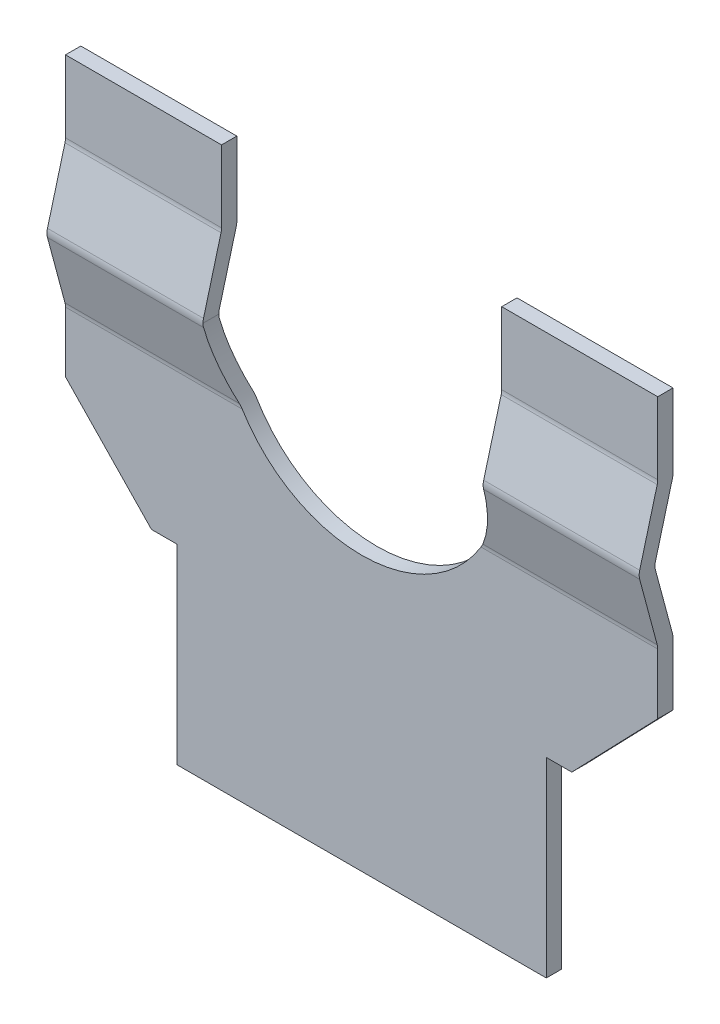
ISO-10303-21;
HEADER;
FILE_DESCRIPTION(('STEP AP214'),'2;1');
FILE_NAME('part.step','',(''),(''),'','','');
FILE_SCHEMA(('AUTOMOTIVE_DESIGN { 1 0 10303 214 1 1 1 1 }'));
ENDSEC;
DATA;
#1=APPLICATION_CONTEXT('core data for automotive mechanical design processes');
#2=APPLICATION_PROTOCOL_DEFINITION('international standard','automotive_design',2000,#1);
#3=PRODUCT_CONTEXT('',#1,'mechanical');
#4=PRODUCT('Part','Part','',(#3));
#5=PRODUCT_RELATED_PRODUCT_CATEGORY('part','',(#4));
#6=PRODUCT_DEFINITION_FORMATION('','',#4);
#7=PRODUCT_DEFINITION_CONTEXT('part definition',#1,'design');
#8=PRODUCT_DEFINITION('design','',#6,#7);
#9=PRODUCT_DEFINITION_SHAPE('','',#8);
#10=(LENGTH_UNIT() NAMED_UNIT(*) SI_UNIT(.MILLI.,.METRE.));
#11=(NAMED_UNIT(*) PLANE_ANGLE_UNIT() SI_UNIT($,.RADIAN.));
#12=(NAMED_UNIT(*) SI_UNIT($,.STERADIAN.) SOLID_ANGLE_UNIT());
#13=UNCERTAINTY_MEASURE_WITH_UNIT(LENGTH_MEASURE(1.E-05),#10,'distance_accuracy_value','');
#14=(GEOMETRIC_REPRESENTATION_CONTEXT(3) GLOBAL_UNCERTAINTY_ASSIGNED_CONTEXT((#13)) GLOBAL_UNIT_ASSIGNED_CONTEXT((#10,
#11,#12)) REPRESENTATION_CONTEXT('',''));
#15=CARTESIAN_POINT('',(0.,0.,0.));
#16=DIRECTION('',(0.,0.,1.));
#17=DIRECTION('',(1.,0.,0.));
#18=AXIS2_PLACEMENT_3D('',#15,#16,#17);
#19=CARTESIAN_POINT('',(0.,325.,0.));
#20=DIRECTION('',(0.,0.,1.));
#21=DIRECTION('',(-1.,0.,0.));
#22=AXIS2_PLACEMENT_3D('',#19,#20,#21);
#23=PLANE('',#22);
#24=DIRECTION('',(0.,-1.,0.));
#25=VECTOR('',#24,1.);
#26=CARTESIAN_POINT('',(232.5,220.,0.));
#27=LINE('',#26,#25);
#28=CARTESIAN_POINT('',(232.5,269.019237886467,0.));
#29=VERTEX_POINT('',#28);
#30=CARTESIAN_POINT('',(232.5,220.,0.));
#31=VERTEX_POINT('',#30);
#32=EDGE_CURVE('E482',#29,#31,#27,.T.);
#33=ORIENTED_EDGE('',*,*,#32,.T.);
#34=DIRECTION('',(-0.694135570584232,-0.719844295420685,0.));
#35=VECTOR('',#34,1.);
#36=CARTESIAN_POINT('',(165.,150.,0.));
#37=LINE('',#36,#35);
#38=CARTESIAN_POINT('',(165.,150.,0.));
#39=VERTEX_POINT('',#38);
#40=EDGE_CURVE('E486',#31,#39,#37,.T.);
#41=ORIENTED_EDGE('',*,*,#40,.T.);
#42=DIRECTION('',(-1.,0.,0.));
#43=VECTOR('',#42,1.);
#44=CARTESIAN_POINT('',(145.,150.,0.));
#45=LINE('',#44,#43);
#46=CARTESIAN_POINT('',(145.,150.,0.));
#47=VERTEX_POINT('',#46);
#48=EDGE_CURVE('E489',#39,#47,#45,.T.);
#49=ORIENTED_EDGE('',*,*,#48,.T.);
#50=DIRECTION('',(0.,-1.,0.));
#51=VECTOR('',#50,1.);
#52=CARTESIAN_POINT('',(145.,0.,0.));
#53=LINE('',#52,#51);
#54=CARTESIAN_POINT('',(145.,0.,0.));
#55=VERTEX_POINT('',#54);
#56=EDGE_CURVE('E492',#47,#55,#53,.T.);
#57=ORIENTED_EDGE('',*,*,#56,.T.);
#58=DIRECTION('',(-1.,0.,0.));
#59=VECTOR('',#58,1.);
#60=CARTESIAN_POINT('',(145.,0.,0.));
#61=LINE('',#60,#59);
#62=CARTESIAN_POINT('',(-145.,0.,0.));
#63=VERTEX_POINT('',#62);
#64=EDGE_CURVE('E495',#55,#63,#61,.T.);
#65=ORIENTED_EDGE('',*,*,#64,.T.);
#66=DIRECTION('',(0.,1.,0.));
#67=VECTOR('',#66,1.);
#68=CARTESIAN_POINT('',(-145.,0.,0.));
#69=LINE('',#68,#67);
#70=CARTESIAN_POINT('',(-145.,150.,0.));
#71=VERTEX_POINT('',#70);
#72=EDGE_CURVE('E498',#63,#71,#69,.T.);
#73=ORIENTED_EDGE('',*,*,#72,.T.);
#74=DIRECTION('',(-1.,0.,0.));
#75=VECTOR('',#74,1.);
#76=CARTESIAN_POINT('',(-145.,150.,0.));
#77=LINE('',#76,#75);
#78=CARTESIAN_POINT('',(-165.,150.,0.));
#79=VERTEX_POINT('',#78);
#80=EDGE_CURVE('E501',#71,#79,#77,.T.);
#81=ORIENTED_EDGE('',*,*,#80,.T.);
#82=DIRECTION('',(-0.694135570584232,0.719844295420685,0.));
#83=VECTOR('',#82,1.);
#84=CARTESIAN_POINT('',(-165.,150.,0.));
#85=LINE('',#84,#83);
#86=CARTESIAN_POINT('',(-232.5,220.,0.));
#87=VERTEX_POINT('',#86);
#88=EDGE_CURVE('E504',#79,#87,#85,.T.);
#89=ORIENTED_EDGE('',*,*,#88,.T.);
#90=DIRECTION('',(0.,1.,0.));
#91=VECTOR('',#90,1.);
#92=CARTESIAN_POINT('',(-232.5,220.,0.));
#93=LINE('',#92,#91);
#94=CARTESIAN_POINT('',(-232.5,269.019237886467,0.));
#95=VERTEX_POINT('',#94);
#96=EDGE_CURVE('E311',#87,#95,#93,.T.);
#97=ORIENTED_EDGE('',*,*,#96,.T.);
#98=DIRECTION('',(-1.,0.,0.));
#99=VECTOR('',#98,1.);
#100=CARTESIAN_POINT('',(0.,269.019237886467,0.));
#101=LINE('',#100,#99);
#102=CARTESIAN_POINT('',(-94.6897791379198,269.019237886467,0.));
#103=VERTEX_POINT('',#102);
#104=EDGE_CURVE('E646',#103,#95,#101,.T.);
#105=ORIENTED_EDGE('',*,*,#104,.F.);
#106=CARTESIAN_POINT('',(0.,325.,0.));
#107=DIRECTION('',(0.,0.,1.));
#108=DIRECTION('',(-1.,0.,0.));
#109=AXIS2_PLACEMENT_3D('',#106,#107,#108);
#110=CIRCLE('',#109,110.);
#111=CARTESIAN_POINT('',(94.6897791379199,269.019237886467,0.));
#112=VERTEX_POINT('',#111);
#113=EDGE_CURVE('E473',#103,#112,#110,.T.);
#114=ORIENTED_EDGE('',*,*,#113,.T.);
#115=DIRECTION('',(-1.,0.,0.));
#116=VECTOR('',#115,1.);
#117=CARTESIAN_POINT('',(0.,269.019237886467,0.));
#118=LINE('',#117,#116);
#119=EDGE_CURVE('E649',#29,#112,#118,.T.);
#120=ORIENTED_EDGE('',*,*,#119,.F.);
#121=EDGE_LOOP('',(#33,#41,#49,#57,#65,#73,#81,#89,#97,#105,#114,#120));
#122=FACE_BOUND('',#121,.T.);
#123=ADVANCED_FACE('F34',(#122),#23,.F.);
#124=CARTESIAN_POINT('',(-232.5,380.980762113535,0.));
#125=VERTEX_POINT('',#124);
#126=CARTESIAN_POINT('',(-232.5,439.,0.));
#127=VERTEX_POINT('',#126);
#128=EDGE_CURVE('E506',#125,#127,#93,.T.);
#129=ORIENTED_EDGE('',*,*,#128,.T.);
#130=DIRECTION('',(1.,0.,0.));
#131=VECTOR('',#130,1.);
#132=CARTESIAN_POINT('',(-232.5,439.,0.));
#133=LINE('',#132,#131);
#134=CARTESIAN_POINT('',(-110.,439.,0.));
#135=VERTEX_POINT('',#134);
#136=EDGE_CURVE('E508',#127,#135,#133,.T.);
#137=ORIENTED_EDGE('',*,*,#136,.T.);
#138=DIRECTION('',(0.,-1.,0.));
#139=VECTOR('',#138,1.);
#140=CARTESIAN_POINT('',(-110.,439.,0.));
#141=LINE('',#140,#139);
#142=CARTESIAN_POINT('',(-110.,380.980762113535,0.));
#143=VERTEX_POINT('',#142);
#144=EDGE_CURVE('E470',#135,#143,#141,.T.);
#145=ORIENTED_EDGE('',*,*,#144,.T.);
#146=DIRECTION('',(1.,0.,0.));
#147=VECTOR('',#146,1.);
#148=CARTESIAN_POINT('',(0.,380.980762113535,0.));
#149=LINE('',#148,#147);
#150=EDGE_CURVE('E524',#125,#143,#149,.T.);
#151=ORIENTED_EDGE('',*,*,#150,.F.);
#152=EDGE_LOOP('',(#129,#137,#145,#151));
#153=FACE_BOUND('',#152,.T.);
#154=ADVANCED_FACE('F522',(#153),#23,.F.);
#155=CARTESIAN_POINT('',(-110.,439.,27.));
#156=DIRECTION('',(-1.,0.,0.));
#157=DIRECTION('',(0.,1.,0.));
#158=AXIS2_PLACEMENT_3D('',#155,#156,#157);
#159=PLANE('',#158);
#160=DIRECTION('',(0.,0.,-1.));
#161=VECTOR('',#160,1.);
#162=CARTESIAN_POINT('',(-110.,325.,27.));
#163=LINE('',#162,#161);
#164=CARTESIAN_POINT('',(-110.,325.,26.576685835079));
#165=VERTEX_POINT('',#164);
#166=CARTESIAN_POINT('',(-110.,325.,14.153371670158));
#167=VERTEX_POINT('',#166);
#168=EDGE_CURVE('E341',#165,#167,#163,.T.);
#169=ORIENTED_EDGE('',*,*,#168,.T.);
#170=CARTESIAN_POINT('',(-110.,325.,2.15337167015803));
#171=DIRECTION('',(1.,0.,0.));
#172=DIRECTION('',(0.,1.,0.));
#173=AXIS2_PLACEMENT_3D('',#170,#171,#172);
#174=CIRCLE('',#173,12.);
#175=CARTESIAN_POINT('',(-110.,328.10582854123,13.7444815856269));
#176=VERTEX_POINT('',#175);
#177=EDGE_CURVE('E46',#176,#167,#174,.T.);
#178=ORIENTED_EDGE('',*,*,#177,.F.);
#179=DIRECTION('',(0.,-0.96592582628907,0.258819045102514));
#180=VECTOR('',#179,1.);
#181=CARTESIAN_POINT('',(-110.,428.257619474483,-13.0911099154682));
#182=LINE('',#181,#180);
#183=CARTESIAN_POINT('',(-110.,377.874933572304,0.408890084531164));
#184=VERTEX_POINT('',#183);
#185=EDGE_CURVE('E695',#184,#176,#182,.T.);
#186=ORIENTED_EDGE('',*,*,#185,.F.);
#187=CARTESIAN_POINT('',(-110.,380.980762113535,12.));
#188=DIRECTION('',(1.,0.,0.));
#189=DIRECTION('',(0.,1.,0.));
#190=AXIS2_PLACEMENT_3D('',#187,#188,#189);
#191=CIRCLE('',#190,12.);
#192=EDGE_CURVE('E430',#143,#184,#191,.F.);
#193=ORIENTED_EDGE('',*,*,#192,.F.);
#194=ORIENTED_EDGE('',*,*,#144,.F.);
#195=DIRECTION('',(0.,0.,-1.));
#196=VECTOR('',#195,1.);
#197=CARTESIAN_POINT('',(-110.,439.,27.));
#198=LINE('',#197,#196);
#199=CARTESIAN_POINT('',(-110.,439.,12.));
#200=VERTEX_POINT('',#199);
#201=EDGE_CURVE('E317',#200,#135,#198,.T.);
#202=ORIENTED_EDGE('',*,*,#201,.F.);
#203=DIRECTION('',(0.,1.,0.));
#204=VECTOR('',#203,1.);
#205=CARTESIAN_POINT('',(-110.,439.,12.));
#206=LINE('',#205,#204);
#207=CARTESIAN_POINT('',(-110.,382.560592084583,12.));
#208=VERTEX_POINT('',#207);
#209=EDGE_CURVE('E450',#208,#200,#206,.T.);
#210=ORIENTED_EDGE('',*,*,#209,.F.);
#211=CARTESIAN_POINT('',(-110.,382.560592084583,24.));
#212=DIRECTION('',(1.,0.,0.));
#213=DIRECTION('',(0.,1.,0.));
#214=AXIS2_PLACEMENT_3D('',#211,#212,#213);
#215=CIRCLE('',#214,12.);
#216=CARTESIAN_POINT('',(-110.,379.454763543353,12.4088900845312));
#217=VERTEX_POINT('',#216);
#218=EDGE_CURVE('E670',#217,#208,#215,.T.);
#219=ORIENTED_EDGE('',*,*,#218,.F.);
#220=DIRECTION('',(0.,0.96592582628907,-0.258819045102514));
#221=VECTOR('',#220,1.);
#222=CARTESIAN_POINT('',(-110.,431.363448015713,-1.49999999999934));
#223=LINE('',#222,#221);
#224=CARTESIAN_POINT('',(-110.,328.10582854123,26.1677957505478));
#225=VERTEX_POINT('',#224);
#226=EDGE_CURVE('E441',#225,#217,#223,.T.);
#227=ORIENTED_EDGE('',*,*,#226,.F.);
#228=CARTESIAN_POINT('',(-110.,325.,14.576685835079));
#229=DIRECTION('',(1.,0.,0.));
#230=DIRECTION('',(0.,1.,0.));
#231=AXIS2_PLACEMENT_3D('',#228,#229,#230);
#232=CIRCLE('',#231,12.);
#233=EDGE_CURVE('E422',#165,#225,#232,.F.);
#234=ORIENTED_EDGE('',*,*,#233,.F.);
#235=EDGE_LOOP('',(#169,#178,#186,#193,#194,#202,#210,#219,#227,#234));
#236=FACE_BOUND('',#235,.T.);
#237=ADVANCED_FACE('F36',(#236),#159,.F.);
#238=CARTESIAN_POINT('',(0.,325.,27.));
#239=DIRECTION('',(0.,0.,-1.));
#240=DIRECTION('',(1.,0.,0.));
#241=AXIS2_PLACEMENT_3D('',#238,#239,#240);
#242=CYLINDRICAL_SURFACE('',#241,110.);
#243=CARTESIAN_POINT('',(0.,325.,27.));
#244=DIRECTION('',(0.,-0.258819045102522,0.965925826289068));
#245=DIRECTION('',(0.,-0.965925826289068,-0.258819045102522));
#246=AXIS2_PLACEMENT_3D('',#243,#244,#245);
#247=ELLIPSE('',#246,113.880379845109,110.);
#248=CARTESIAN_POINT('',(-95.575513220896,270.545236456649,12.4088900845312));
#249=VERTEX_POINT('',#248);
#250=CARTESIAN_POINT('',(-109.956145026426,321.89417145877,26.1677957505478));
#251=VERTEX_POINT('',#250);
#252=EDGE_CURVE('E428',#249,#251,#247,.F.);
#253=ORIENTED_EDGE('',*,*,#252,.F.);
#254=CARTESIAN_POINT('',(-93.7378164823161,267.439407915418,12.));
#255=CARTESIAN_POINT('',(-93.8968021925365,267.698306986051,11.9999993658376));
#256=CARTESIAN_POINT('',(-94.054714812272,267.95788452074,12.0083790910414));
#257=CARTESIAN_POINT('',(-94.3673825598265,268.476657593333,12.0420965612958));
#258=CARTESIAN_POINT('',(-94.5221464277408,268.735851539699,12.0673779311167));
#259=CARTESIAN_POINT('',(-94.8285722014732,269.253857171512,12.1350939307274));
#260=CARTESIAN_POINT('',(-94.9802340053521,269.512668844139,12.1775291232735));
#261=CARTESIAN_POINT('',(-95.2804615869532,270.029793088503,12.2799475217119));
#262=CARTESIAN_POINT('',(-95.4290153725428,270.28810112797,12.3399886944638));
#263=CARTESIAN_POINT('',(-95.575513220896,270.545236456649,12.4088900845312));
#264=B_SPLINE_CURVE_WITH_KNOTS('',3,(#254,#255,#256,#257,#258,#259,#260,#261,#262,#263),
.UNSPECIFIED.,.F.,.F.,(4,2,2,2,4),(0.,0.911358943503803,1.81969312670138,2.72805711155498,
3.63944608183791),.UNSPECIFIED.);
#265=CARTESIAN_POINT('',(-93.7378164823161,267.439407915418,12.));
#266=VERTEX_POINT('',#265);
#267=EDGE_CURVE('E591',#266,#249,#264,.T.);
#268=ORIENTED_EDGE('',*,*,#267,.F.);
#269=CARTESIAN_POINT('',(0.,325.,12.));
#270=DIRECTION('',(0.,0.,1.));
#271=DIRECTION('',(0.,1.,0.));
#272=AXIS2_PLACEMENT_3D('',#269,#270,#271);
#273=CIRCLE('',#272,110.);
#274=CARTESIAN_POINT('',(93.7378164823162,267.439407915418,12.));
#275=VERTEX_POINT('',#274);
#276=EDGE_CURVE('E468',#275,#266,#273,.F.);
#277=ORIENTED_EDGE('',*,*,#276,.F.);
#278=CARTESIAN_POINT('',(95.5755132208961,270.545236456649,12.4088900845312));
#279=CARTESIAN_POINT('',(95.4290153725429,270.28810112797,12.3399886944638));
#280=CARTESIAN_POINT('',(95.2804615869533,270.029793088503,12.2799475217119));
#281=CARTESIAN_POINT('',(94.9802340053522,269.512668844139,12.1775291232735));
#282=CARTESIAN_POINT('',(94.8285722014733,269.253857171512,12.1350939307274));
#283=CARTESIAN_POINT('',(94.5221464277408,268.735851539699,12.0673779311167));
#284=CARTESIAN_POINT('',(94.3673825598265,268.476657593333,12.0420965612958));
#285=CARTESIAN_POINT('',(94.0547148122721,267.95788452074,12.0083790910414));
#286=CARTESIAN_POINT('',(93.8968021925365,267.698306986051,11.9999993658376));
#287=CARTESIAN_POINT('',(93.7378164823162,267.439407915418,12.));
#288=B_SPLINE_CURVE_WITH_KNOTS('',3,(#278,#279,#280,#281,#282,#283,#284,#285,#286,#287),
.UNSPECIFIED.,.F.,.F.,(4,2,2,2,4),(0.,0.911388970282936,1.81975295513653,2.72808713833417,
3.63944608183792),.UNSPECIFIED.);
#289=CARTESIAN_POINT('',(95.5755132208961,270.545236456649,12.4088900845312));
#290=VERTEX_POINT('',#289);
#291=EDGE_CURVE('E582',#290,#275,#288,.T.);
#292=ORIENTED_EDGE('',*,*,#291,.F.);
#293=CARTESIAN_POINT('',(109.956145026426,321.89417145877,26.1677957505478));
#294=VERTEX_POINT('',#293);
#295=EDGE_CURVE('E438',#294,#290,#247,.F.);
#296=ORIENTED_EDGE('',*,*,#295,.F.);
#297=CARTESIAN_POINT('',(110.,325.,26.576685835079));
#298=CARTESIAN_POINT('',(110.000005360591,324.737599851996,26.5766986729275));
#299=CARTESIAN_POINT('',(109.999061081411,324.475201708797,26.568079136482));
#300=CARTESIAN_POINT('',(109.99532164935,323.952675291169,26.5337461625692));
#301=CARTESIAN_POINT('',(109.99253449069,323.69254210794,26.5081065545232));
#302=CARTESIAN_POINT('',(109.985157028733,323.174530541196,26.4399024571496));
#303=CARTESIAN_POINT('',(109.980566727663,322.916652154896,26.3973379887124));
#304=CARTESIAN_POINT('',(109.969645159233,322.403145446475,26.2952712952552));
#305=CARTESIAN_POINT('',(109.963306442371,322.147531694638,26.2356965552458));
#306=CARTESIAN_POINT('',(109.956145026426,321.89417145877,26.1677957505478));
#307=B_SPLINE_CURVE_WITH_KNOTS('',3,(#297,#298,#299,#300,#301,#302,#303,#304,#305,#306),
.UNSPECIFIED.,.F.,.F.,(4,2,2,2,4),(0.,0.787054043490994,1.57071613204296,2.35437725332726,
3.14143032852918),.UNSPECIFIED.);
#308=CARTESIAN_POINT('',(110.,325.,26.576685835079));
#309=VERTEX_POINT('',#308);
#310=EDGE_CURVE('E431',#309,#294,#307,.T.);
#311=ORIENTED_EDGE('',*,*,#310,.F.);
#312=DIRECTION('',(0.,0.,-1.));
#313=VECTOR('',#312,1.);
#314=CARTESIAN_POINT('',(110.,325.,27.));
#315=LINE('',#314,#313);
#316=CARTESIAN_POINT('',(110.,325.,14.153371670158));
#317=VERTEX_POINT('',#316);
#318=EDGE_CURVE('E338',#309,#317,#315,.T.);
#319=ORIENTED_EDGE('',*,*,#318,.T.);
#320=CARTESIAN_POINT('',(109.956145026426,321.89417145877,13.7444815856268));
#321=CARTESIAN_POINT('',(109.963306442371,322.147531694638,13.8123823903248));
#322=CARTESIAN_POINT('',(109.969645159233,322.403145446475,13.8719571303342));
#323=CARTESIAN_POINT('',(109.980566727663,322.916652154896,13.9740238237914));
#324=CARTESIAN_POINT('',(109.985157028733,323.174530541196,14.0165882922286));
#325=CARTESIAN_POINT('',(109.99253449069,323.69254210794,14.0847923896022));
#326=CARTESIAN_POINT('',(109.99532164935,323.952675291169,14.1104319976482));
#327=CARTESIAN_POINT('',(109.999061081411,324.475201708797,14.1447649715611));
#328=CARTESIAN_POINT('',(110.000005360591,324.737599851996,14.1533845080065));
#329=CARTESIAN_POINT('',(110.,325.,14.153371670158));
#330=B_SPLINE_CURVE_WITH_KNOTS('',3,(#320,#321,#322,#323,#324,#325,#326,#327,#328,#329),
.UNSPECIFIED.,.F.,.F.,(4,2,2,2,4),(0.,0.787053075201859,1.57071419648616,2.35437628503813,
3.14143032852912),.UNSPECIFIED.);
#331=CARTESIAN_POINT('',(109.956145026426,321.89417145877,13.7444815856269));
#332=VERTEX_POINT('',#331);
#333=EDGE_CURVE('E398',#332,#317,#330,.T.);
#334=ORIENTED_EDGE('',*,*,#333,.F.);
#335=CARTESIAN_POINT('',(0.,325.,14.576685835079));
#336=DIRECTION('',(0.,0.258819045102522,-0.965925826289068));
#337=DIRECTION('',(0.,-0.965925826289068,-0.258819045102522));
#338=AXIS2_PLACEMENT_3D('',#335,#336,#337);
#339=ELLIPSE('',#338,113.880379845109,110.);
#340=CARTESIAN_POINT('',(96.4584957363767,272.125066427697,0.4088900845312));
#341=VERTEX_POINT('',#340);
#342=EDGE_CURVE('E296',#341,#332,#339,.F.);
#343=ORIENTED_EDGE('',*,*,#342,.F.);
#344=CARTESIAN_POINT('',(94.6897791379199,269.019237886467,0.));
#345=CARTESIAN_POINT('',(94.8429469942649,269.278306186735,-1.33023910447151E-06));
#346=CARTESIAN_POINT('',(94.9950504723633,269.538022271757,0.00839002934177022));
#347=CARTESIAN_POINT('',(95.2961385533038,270.056980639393,0.0421376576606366));
#348=CARTESIAN_POINT('',(95.445131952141,270.316221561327,0.067436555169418));
#349=CARTESIAN_POINT('',(95.7400551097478,270.834229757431,0.135176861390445));
#350=CARTESIAN_POINT('',(95.8859847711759,271.092997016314,0.177618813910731));
#351=CARTESIAN_POINT('',(96.1747903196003,271.609944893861,0.280020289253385));
#352=CARTESIAN_POINT('',(96.3176541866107,271.868120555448,0.34003866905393));
#353=CARTESIAN_POINT('',(96.4584957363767,272.125066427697,0.408890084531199));
#354=B_SPLINE_CURVE_WITH_KNOTS('',3,(#344,#345,#346,#347,#348,#349,#350,#351,#352,#353),
.UNSPECIFIED.,.F.,.F.,(4,2,2,2,4),(0.,0.902782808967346,1.80251771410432,2.70228116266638,
3.60509272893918),.UNSPECIFIED.);
#355=EDGE_CURVE('E370',#112,#341,#354,.T.);
#356=ORIENTED_EDGE('',*,*,#355,.F.);
#357=ORIENTED_EDGE('',*,*,#113,.F.);
#358=CARTESIAN_POINT('',(-96.4584957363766,272.125066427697,0.40889008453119));
#359=CARTESIAN_POINT('',(-96.3176541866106,271.868120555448,0.340038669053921));
#360=CARTESIAN_POINT('',(-96.1747903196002,271.609944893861,0.280020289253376));
#361=CARTESIAN_POINT('',(-95.8859847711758,271.092997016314,0.177618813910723));
#362=CARTESIAN_POINT('',(-95.7400551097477,270.834229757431,0.135176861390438));
#363=CARTESIAN_POINT('',(-95.4451319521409,270.316221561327,0.0674365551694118));
#364=CARTESIAN_POINT('',(-95.2961385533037,270.056980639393,0.0421376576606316));
#365=CARTESIAN_POINT('',(-94.9950504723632,269.538022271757,0.00839002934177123));
#366=CARTESIAN_POINT('',(-94.8429469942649,269.278306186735,-1.33023910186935E-06));
#367=CARTESIAN_POINT('',(-94.6897791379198,269.019237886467,0.));
#368=B_SPLINE_CURVE_WITH_KNOTS('',3,(#358,#359,#360,#361,#362,#363,#364,#365,#366,#367),
.UNSPECIFIED.,.F.,.F.,(4,2,2,2,4),(0.,0.902811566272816,1.80257501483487,2.7023099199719,
3.60509272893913),.UNSPECIFIED.);
#369=CARTESIAN_POINT('',(-96.4584957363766,272.125066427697,0.408890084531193));
#370=VERTEX_POINT('',#369);
#371=EDGE_CURVE('E364',#370,#103,#368,.T.);
#372=ORIENTED_EDGE('',*,*,#371,.F.);
#373=CARTESIAN_POINT('',(-109.956145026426,321.89417145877,13.7444815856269));
#374=VERTEX_POINT('',#373);
#375=EDGE_CURVE('E692',#374,#370,#339,.F.);
#376=ORIENTED_EDGE('',*,*,#375,.F.);
#377=CARTESIAN_POINT('',(-110.,325.,14.153371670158));
#378=CARTESIAN_POINT('',(-110.000005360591,324.737599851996,14.1533845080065));
#379=CARTESIAN_POINT('',(-109.999061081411,324.475201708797,14.1447649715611));
#380=CARTESIAN_POINT('',(-109.99532164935,323.952675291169,14.1104319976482));
#381=CARTESIAN_POINT('',(-109.992534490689,323.69254210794,14.0847923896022));
#382=CARTESIAN_POINT('',(-109.985157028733,323.174530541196,14.0165882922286));
#383=CARTESIAN_POINT('',(-109.980566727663,322.916652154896,13.9740238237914));
#384=CARTESIAN_POINT('',(-109.969645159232,322.403145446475,13.8719571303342));
#385=CARTESIAN_POINT('',(-109.963306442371,322.147531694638,13.8123823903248));
#386=CARTESIAN_POINT('',(-109.956145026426,321.89417145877,13.7444815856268));
#387=B_SPLINE_CURVE_WITH_KNOTS('',3,(#377,#378,#379,#380,#381,#382,#383,#384,#385,#386),
.UNSPECIFIED.,.F.,.F.,(4,2,2,2,4),(0.,0.787054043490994,1.57071613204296,2.35437725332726,
3.14143032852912),.UNSPECIFIED.);
#388=EDGE_CURVE('E11',#167,#374,#387,.T.);
#389=ORIENTED_EDGE('',*,*,#388,.F.);
#390=ORIENTED_EDGE('',*,*,#168,.F.);
#391=CARTESIAN_POINT('',(-109.956145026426,321.89417145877,26.1677957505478));
#392=CARTESIAN_POINT('',(-109.963306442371,322.147531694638,26.2356965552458));
#393=CARTESIAN_POINT('',(-109.969645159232,322.403145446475,26.2952712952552));
#394=CARTESIAN_POINT('',(-109.980566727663,322.916652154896,26.3973379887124));
#395=CARTESIAN_POINT('',(-109.985157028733,323.174530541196,26.4399024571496));
#396=CARTESIAN_POINT('',(-109.992534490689,323.69254210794,26.5081065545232));
#397=CARTESIAN_POINT('',(-109.99532164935,323.952675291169,26.5337461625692));
#398=CARTESIAN_POINT('',(-109.999061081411,324.475201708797,26.568079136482));
#399=CARTESIAN_POINT('',(-110.000005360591,324.737599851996,26.5766986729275));
#400=CARTESIAN_POINT('',(-110.,325.,26.576685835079));
#401=B_SPLINE_CURVE_WITH_KNOTS('',3,(#391,#392,#393,#394,#395,#396,#397,#398,#399,#400),
.UNSPECIFIED.,.F.,.F.,(4,2,2,2,4),(0.,0.787053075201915,1.57071419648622,2.35437628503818,
3.14143032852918),.UNSPECIFIED.);
#402=EDGE_CURVE('E425',#251,#165,#401,.T.);
#403=ORIENTED_EDGE('',*,*,#402,.F.);
#404=EDGE_LOOP('',(#253,#268,#277,#292,#296,#311,#319,#334,#343,#356,#357,#372,#376,#389,#390,#403));
#405=FACE_BOUND('',#404,.T.);
#406=ADVANCED_FACE('F376',(#405),#242,.F.);
#407=CARTESIAN_POINT('',(110.,439.,27.));
#408=DIRECTION('',(1.,0.,0.));
#409=DIRECTION('',(0.,-1.,0.));
#410=AXIS2_PLACEMENT_3D('',#407,#408,#409);
#411=PLANE('',#410);
#412=DIRECTION('',(0.,-0.96592582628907,0.258819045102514));
#413=VECTOR('',#412,1.);
#414=CARTESIAN_POINT('',(110.,431.363448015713,-1.49999999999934));
#415=LINE('',#414,#413);
#416=CARTESIAN_POINT('',(110.,379.454763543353,12.4088900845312));
#417=VERTEX_POINT('',#416);
#418=CARTESIAN_POINT('',(110.,328.10582854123,26.1677957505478));
#419=VERTEX_POINT('',#418);
#420=EDGE_CURVE('E437',#417,#419,#415,.T.);
#421=ORIENTED_EDGE('',*,*,#420,.F.);
#422=CARTESIAN_POINT('',(110.,382.560592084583,24.));
#423=DIRECTION('',(-1.,0.,0.));
#424=DIRECTION('',(0.,-1.,0.));
#425=AXIS2_PLACEMENT_3D('',#422,#423,#424);
#426=CIRCLE('',#425,12.);
#427=CARTESIAN_POINT('',(110.,382.560592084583,12.));
#428=VERTEX_POINT('',#427);
#429=EDGE_CURVE('E577',#428,#417,#426,.T.);
#430=ORIENTED_EDGE('',*,*,#429,.F.);
#431=DIRECTION('',(0.,-1.,0.));
#432=VECTOR('',#431,1.);
#433=CARTESIAN_POINT('',(110.,439.,12.));
#434=LINE('',#433,#432);
#435=CARTESIAN_POINT('',(110.,439.,12.));
#436=VERTEX_POINT('',#435);
#437=EDGE_CURVE('E306',#436,#428,#434,.T.);
#438=ORIENTED_EDGE('',*,*,#437,.F.);
#439=DIRECTION('',(0.,0.,-1.));
#440=VECTOR('',#439,1.);
#441=CARTESIAN_POINT('',(110.,439.,27.));
#442=LINE('',#441,#440);
#443=CARTESIAN_POINT('',(110.,439.,0.));
#444=VERTEX_POINT('',#443);
#445=EDGE_CURVE('E335',#436,#444,#442,.T.);
#446=ORIENTED_EDGE('',*,*,#445,.T.);
#447=DIRECTION('',(0.,1.,0.));
#448=VECTOR('',#447,1.);
#449=CARTESIAN_POINT('',(110.,439.,0.));
#450=LINE('',#449,#448);
#451=CARTESIAN_POINT('',(110.,380.980762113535,0.));
#452=VERTEX_POINT('',#451);
#453=EDGE_CURVE('E476',#452,#444,#450,.T.);
#454=ORIENTED_EDGE('',*,*,#453,.F.);
#455=CARTESIAN_POINT('',(110.,380.980762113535,12.));
#456=DIRECTION('',(-1.,0.,0.));
#457=DIRECTION('',(0.,-1.,0.));
#458=AXIS2_PLACEMENT_3D('',#455,#456,#457);
#459=CIRCLE('',#458,12.);
#460=CARTESIAN_POINT('',(110.,377.874933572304,0.408890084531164));
#461=VERTEX_POINT('',#460);
#462=EDGE_CURVE('E635',#461,#452,#459,.F.);
#463=ORIENTED_EDGE('',*,*,#462,.F.);
#464=DIRECTION('',(0.,0.96592582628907,-0.258819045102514));
#465=VECTOR('',#464,1.);
#466=CARTESIAN_POINT('',(110.,428.257619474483,-13.0911099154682));
#467=LINE('',#466,#465);
#468=CARTESIAN_POINT('',(110.,328.10582854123,13.7444815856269));
#469=VERTEX_POINT('',#468);
#470=EDGE_CURVE('E1022',#469,#461,#467,.T.);
#471=ORIENTED_EDGE('',*,*,#470,.F.);
#472=CARTESIAN_POINT('',(110.,325.,2.15337167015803));
#473=DIRECTION('',(-1.,0.,0.));
#474=DIRECTION('',(0.,-1.,0.));
#475=AXIS2_PLACEMENT_3D('',#472,#473,#474);
#476=CIRCLE('',#475,12.);
#477=EDGE_CURVE('E59',#317,#469,#476,.T.);
#478=ORIENTED_EDGE('',*,*,#477,.F.);
#479=ORIENTED_EDGE('',*,*,#318,.F.);
#480=CARTESIAN_POINT('',(110.,325.,14.576685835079));
#481=DIRECTION('',(-1.,0.,0.));
#482=DIRECTION('',(0.,-1.,0.));
#483=AXIS2_PLACEMENT_3D('',#480,#481,#482);
#484=CIRCLE('',#483,12.);
#485=EDGE_CURVE('E637',#419,#309,#484,.F.);
#486=ORIENTED_EDGE('',*,*,#485,.F.);
#487=EDGE_LOOP('',(#421,#430,#438,#446,#454,#463,#471,#478,#479,#486));
#488=FACE_BOUND('',#487,.T.);
#489=ADVANCED_FACE('F574',(#488),#411,.F.);
#490=CARTESIAN_POINT('',(232.5,439.,27.));
#491=DIRECTION('',(0.,-1.,0.));
#492=DIRECTION('',(0.,0.,-1.));
#493=AXIS2_PLACEMENT_3D('',#490,#491,#492);
#494=PLANE('',#493);
#495=DIRECTION('',(0.,0.,-1.));
#496=VECTOR('',#495,1.);
#497=CARTESIAN_POINT('',(232.5,439.,27.));
#498=LINE('',#497,#496);
#499=CARTESIAN_POINT('',(232.5,439.,12.));
#500=VERTEX_POINT('',#499);
#501=CARTESIAN_POINT('',(232.5,439.,0.));
#502=VERTEX_POINT('',#501);
#503=EDGE_CURVE('E332',#500,#502,#498,.T.);
#504=ORIENTED_EDGE('',*,*,#503,.T.);
#505=DIRECTION('',(1.,0.,0.));
#506=VECTOR('',#505,1.);
#507=CARTESIAN_POINT('',(232.5,439.,0.));
#508=LINE('',#507,#506);
#509=EDGE_CURVE('E479',#444,#502,#508,.T.);
#510=ORIENTED_EDGE('',*,*,#509,.F.);
#511=ORIENTED_EDGE('',*,*,#445,.F.);
#512=DIRECTION('',(-1.,0.,0.));
#513=VECTOR('',#512,1.);
#514=CARTESIAN_POINT('',(232.5,439.,12.));
#515=LINE('',#514,#513);
#516=EDGE_CURVE('E453',#500,#436,#515,.T.);
#517=ORIENTED_EDGE('',*,*,#516,.F.);
#518=EDGE_LOOP('',(#504,#510,#511,#517));
#519=FACE_BOUND('',#518,.T.);
#520=ADVANCED_FACE('F559',(#519),#494,.F.);
#521=CARTESIAN_POINT('',(232.5,220.,27.));
#522=DIRECTION('',(-1.,0.,0.));
#523=DIRECTION('',(0.,0.,-1.));
#524=AXIS2_PLACEMENT_3D('',#521,#522,#523);
#525=PLANE('',#524);
#526=DIRECTION('',(0.,0.965925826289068,0.258819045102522));
#527=VECTOR('',#526,1.);
#528=CARTESIAN_POINT('',(232.5,269.019237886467,12.));
#529=LINE('',#528,#527);
#530=CARTESIAN_POINT('',(232.5,270.545236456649,12.4088900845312));
#531=VERTEX_POINT('',#530);
#532=CARTESIAN_POINT('',(232.5,321.89417145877,26.1677957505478));
#533=VERTEX_POINT('',#532);
#534=EDGE_CURVE('E538',#531,#533,#529,.T.);
#535=ORIENTED_EDGE('',*,*,#534,.F.);
#536=CARTESIAN_POINT('',(232.5,267.439407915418,24.));
#537=DIRECTION('',(1.,0.,0.));
#538=DIRECTION('',(0.,0.,-1.));
#539=AXIS2_PLACEMENT_3D('',#536,#537,#538);
#540=CIRCLE('',#539,12.);
#541=CARTESIAN_POINT('',(232.5,267.439407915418,12.));
#542=VERTEX_POINT('',#541);
#543=EDGE_CURVE('E580',#542,#531,#540,.T.);
#544=ORIENTED_EDGE('',*,*,#543,.F.);
#545=DIRECTION('',(0.,1.,0.));
#546=VECTOR('',#545,1.);
#547=CARTESIAN_POINT('',(232.5,-31.6797982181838,12.));
#548=LINE('',#547,#546);
#549=CARTESIAN_POINT('',(232.5,220.,12.));
#550=VERTEX_POINT('',#549);
#551=EDGE_CURVE('E534',#550,#542,#548,.T.);
#552=ORIENTED_EDGE('',*,*,#551,.F.);
#553=DIRECTION('',(0.,0.,-1.));
#554=VECTOR('',#553,1.);
#555=CARTESIAN_POINT('',(232.5,220.,27.));
#556=LINE('',#555,#554);
#557=EDGE_CURVE('E330',#550,#31,#556,.T.);
#558=ORIENTED_EDGE('',*,*,#557,.T.);
#559=ORIENTED_EDGE('',*,*,#32,.F.);
#560=CARTESIAN_POINT('',(232.5,269.019237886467,12.));
#561=DIRECTION('',(1.,0.,0.));
#562=DIRECTION('',(0.,0.,-1.));
#563=AXIS2_PLACEMENT_3D('',#560,#561,#562);
#564=CIRCLE('',#563,12.);
#565=CARTESIAN_POINT('',(232.5,272.125066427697,0.40889008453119));
#566=VERTEX_POINT('',#565);
#567=EDGE_CURVE('E640',#566,#29,#564,.F.);
#568=ORIENTED_EDGE('',*,*,#567,.F.);
#569=DIRECTION('',(0.,-0.965925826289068,-0.258819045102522));
#570=VECTOR('',#569,1.);
#571=CARTESIAN_POINT('',(232.5,325.,14.576685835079));
#572=LINE('',#571,#570);
#573=CARTESIAN_POINT('',(232.5,321.89417145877,13.7444815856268));
#574=VERTEX_POINT('',#573);
#575=EDGE_CURVE('E1013',#574,#566,#572,.T.);
#576=ORIENTED_EDGE('',*,*,#575,.F.);
#577=CARTESIAN_POINT('',(232.5,325.,2.15337167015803));
#578=DIRECTION('',(1.,0.,0.));
#579=DIRECTION('',(0.,0.,-1.));
#580=AXIS2_PLACEMENT_3D('',#577,#578,#579);
#581=CIRCLE('',#580,12.);
#582=CARTESIAN_POINT('',(232.5,328.10582854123,13.7444815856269));
#583=VERTEX_POINT('',#582);
#584=EDGE_CURVE('E407',#583,#574,#581,.T.);
#585=ORIENTED_EDGE('',*,*,#584,.F.);
#586=DIRECTION('',(0.,-0.96592582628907,0.258819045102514));
#587=VECTOR('',#586,1.);
#588=CARTESIAN_POINT('',(232.5,325.,14.576685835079));
#589=LINE('',#588,#587);
#590=CARTESIAN_POINT('',(232.5,377.874933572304,0.40889008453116));
#591=VERTEX_POINT('',#590);
#592=EDGE_CURVE('E1016',#591,#583,#589,.T.);
#593=ORIENTED_EDGE('',*,*,#592,.F.);
#594=CARTESIAN_POINT('',(232.5,380.980762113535,12.));
#595=DIRECTION('',(1.,0.,0.));
#596=DIRECTION('',(0.,0.,-1.));
#597=AXIS2_PLACEMENT_3D('',#594,#595,#596);
#598=CIRCLE('',#597,12.);
#599=CARTESIAN_POINT('',(232.5,380.980762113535,0.));
#600=VERTEX_POINT('',#599);
#601=EDGE_CURVE('E566',#600,#591,#598,.F.);
#602=ORIENTED_EDGE('',*,*,#601,.F.);
#603=EDGE_CURVE('E483',#502,#600,#27,.T.);
#604=ORIENTED_EDGE('',*,*,#603,.F.);
#605=ORIENTED_EDGE('',*,*,#503,.F.);
#606=DIRECTION('',(0.,1.,0.));
#607=VECTOR('',#606,1.);
#608=CARTESIAN_POINT('',(232.5,380.980762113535,12.));
#609=LINE('',#608,#607);
#610=CARTESIAN_POINT('',(232.5,382.560592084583,12.));
#611=VERTEX_POINT('',#610);
#612=EDGE_CURVE('E444',#611,#500,#609,.T.);
#613=ORIENTED_EDGE('',*,*,#612,.F.);
#614=CARTESIAN_POINT('',(232.5,382.560592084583,24.));
#615=DIRECTION('',(1.,0.,0.));
#616=DIRECTION('',(0.,0.,-1.));
#617=AXIS2_PLACEMENT_3D('',#614,#615,#616);
#618=CIRCLE('',#617,12.);
#619=CARTESIAN_POINT('',(232.5,379.454763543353,12.4088900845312));
#620=VERTEX_POINT('',#619);
#621=EDGE_CURVE('E404',#620,#611,#618,.T.);
#622=ORIENTED_EDGE('',*,*,#621,.F.);
#623=DIRECTION('',(0.,0.96592582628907,-0.258819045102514));
#624=VECTOR('',#623,1.);
#625=CARTESIAN_POINT('',(232.5,325.,27.));
#626=LINE('',#625,#624);
#627=CARTESIAN_POINT('',(232.5,328.10582854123,26.1677957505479));
#628=VERTEX_POINT('',#627);
#629=EDGE_CURVE('E544',#628,#620,#626,.T.);
#630=ORIENTED_EDGE('',*,*,#629,.F.);
#631=CARTESIAN_POINT('',(232.5,325.,14.576685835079));
#632=DIRECTION('',(1.,0.,0.));
#633=DIRECTION('',(0.,0.,-1.));
#634=AXIS2_PLACEMENT_3D('',#631,#632,#633);
#635=CIRCLE('',#634,12.);
#636=EDGE_CURVE('E642',#533,#628,#635,.F.);
#637=ORIENTED_EDGE('',*,*,#636,.F.);
#638=EDGE_LOOP('',(#535,#544,#552,#558,#559,#568,#576,#585,#593,#602,#604,#605,#613,#622,#630,#637));
#639=FACE_BOUND('',#638,.T.);
#640=ADVANCED_FACE('F562',(#639),#525,.F.);
#641=CARTESIAN_POINT('',(165.,150.,27.));
#642=DIRECTION('',(-0.719844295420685,0.694135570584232,0.));
#643=DIRECTION('',(0.694135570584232,0.719844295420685,0.));
#644=AXIS2_PLACEMENT_3D('',#641,#642,#643);
#645=PLANE('',#644);
#646=DIRECTION('',(0.,0.,-1.));
#647=VECTOR('',#646,1.);
#648=CARTESIAN_POINT('',(165.,150.,27.));
#649=LINE('',#648,#647);
#650=CARTESIAN_POINT('',(165.,150.,12.));
#651=VERTEX_POINT('',#650);
#652=EDGE_CURVE('E328',#651,#39,#649,.T.);
#653=ORIENTED_EDGE('',*,*,#652,.T.);
#654=ORIENTED_EDGE('',*,*,#40,.F.);
#655=ORIENTED_EDGE('',*,*,#557,.F.);
#656=DIRECTION('',(0.694135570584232,0.719844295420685,0.));
#657=VECTOR('',#656,1.);
#658=CARTESIAN_POINT('',(165.,150.,12.));
#659=LINE('',#658,#657);
#660=EDGE_CURVE('E466',#651,#550,#659,.T.);
#661=ORIENTED_EDGE('',*,*,#660,.F.);
#662=EDGE_LOOP('',(#653,#654,#655,#661));
#663=FACE_BOUND('',#662,.T.);
#664=ADVANCED_FACE('F755',(#663),#645,.F.);
#665=CARTESIAN_POINT('',(145.,150.,27.));
#666=DIRECTION('',(0.,1.,0.));
#667=DIRECTION('',(0.,0.,1.));
#668=AXIS2_PLACEMENT_3D('',#665,#666,#667);
#669=PLANE('',#668);
#670=DIRECTION('',(0.,0.,-1.));
#671=VECTOR('',#670,1.);
#672=CARTESIAN_POINT('',(145.,150.,27.));
#673=LINE('',#672,#671);
#674=CARTESIAN_POINT('',(145.,150.,12.));
#675=VERTEX_POINT('',#674);
#676=EDGE_CURVE('E326',#675,#47,#673,.T.);
#677=ORIENTED_EDGE('',*,*,#676,.T.);
#678=ORIENTED_EDGE('',*,*,#48,.F.);
#679=ORIENTED_EDGE('',*,*,#652,.F.);
#680=DIRECTION('',(1.,0.,0.));
#681=VECTOR('',#680,1.);
#682=CARTESIAN_POINT('',(145.,150.,12.));
#683=LINE('',#682,#681);
#684=EDGE_CURVE('E464',#675,#651,#683,.T.);
#685=ORIENTED_EDGE('',*,*,#684,.F.);
#686=EDGE_LOOP('',(#677,#678,#679,#685));
#687=FACE_BOUND('',#686,.T.);
#688=ADVANCED_FACE('F751',(#687),#669,.F.);
#689=CARTESIAN_POINT('',(145.,0.,27.));
#690=DIRECTION('',(-1.,0.,0.));
#691=DIRECTION('',(0.,0.,-1.));
#692=AXIS2_PLACEMENT_3D('',#689,#690,#691);
#693=PLANE('',#692);
#694=DIRECTION('',(0.,0.,-1.));
#695=VECTOR('',#694,1.);
#696=CARTESIAN_POINT('',(145.,0.,27.));
#697=LINE('',#696,#695);
#698=CARTESIAN_POINT('',(145.,0.,12.));
#699=VERTEX_POINT('',#698);
#700=EDGE_CURVE('E324',#699,#55,#697,.T.);
#701=ORIENTED_EDGE('',*,*,#700,.T.);
#702=ORIENTED_EDGE('',*,*,#56,.F.);
#703=ORIENTED_EDGE('',*,*,#676,.F.);
#704=DIRECTION('',(0.,1.,0.));
#705=VECTOR('',#704,1.);
#706=CARTESIAN_POINT('',(145.,0.,12.));
#707=LINE('',#706,#705);
#708=EDGE_CURVE('E462',#699,#675,#707,.T.);
#709=ORIENTED_EDGE('',*,*,#708,.F.);
#710=EDGE_LOOP('',(#701,#702,#703,#709));
#711=FACE_BOUND('',#710,.T.);
#712=ADVANCED_FACE('F747',(#711),#693,.F.);
#713=CARTESIAN_POINT('',(145.,0.,27.));
#714=DIRECTION('',(0.,1.,0.));
#715=DIRECTION('',(0.,0.,1.));
#716=AXIS2_PLACEMENT_3D('',#713,#714,#715);
#717=PLANE('',#716);
#718=DIRECTION('',(0.,0.,-1.));
#719=VECTOR('',#718,1.);
#720=CARTESIAN_POINT('',(-145.,0.,27.));
#721=LINE('',#720,#719);
#722=CARTESIAN_POINT('',(-145.,0.,12.));
#723=VERTEX_POINT('',#722);
#724=EDGE_CURVE('E322',#723,#63,#721,.T.);
#725=ORIENTED_EDGE('',*,*,#724,.T.);
#726=ORIENTED_EDGE('',*,*,#64,.F.);
#727=ORIENTED_EDGE('',*,*,#700,.F.);
#728=DIRECTION('',(1.,0.,0.));
#729=VECTOR('',#728,1.);
#730=CARTESIAN_POINT('',(145.,0.,12.));
#731=LINE('',#730,#729);
#732=EDGE_CURVE('E460',#723,#699,#731,.T.);
#733=ORIENTED_EDGE('',*,*,#732,.F.);
#734=EDGE_LOOP('',(#725,#726,#727,#733));
#735=FACE_BOUND('',#734,.T.);
#736=ADVANCED_FACE('F743',(#735),#717,.F.);
#737=CARTESIAN_POINT('',(-145.,0.,27.));
#738=DIRECTION('',(1.,0.,0.));
#739=DIRECTION('',(0.,0.,1.));
#740=AXIS2_PLACEMENT_3D('',#737,#738,#739);
#741=PLANE('',#740);
#742=DIRECTION('',(0.,0.,-1.));
#743=VECTOR('',#742,1.);
#744=CARTESIAN_POINT('',(-145.,150.,27.));
#745=LINE('',#744,#743);
#746=CARTESIAN_POINT('',(-145.,150.,12.));
#747=VERTEX_POINT('',#746);
#748=EDGE_CURVE('E315',#747,#71,#745,.T.);
#749=ORIENTED_EDGE('',*,*,#748,.T.);
#750=ORIENTED_EDGE('',*,*,#72,.F.);
#751=ORIENTED_EDGE('',*,*,#724,.F.);
#752=DIRECTION('',(0.,-1.,0.));
#753=VECTOR('',#752,1.);
#754=CARTESIAN_POINT('',(-145.,0.,12.));
#755=LINE('',#754,#753);
#756=EDGE_CURVE('E458',#747,#723,#755,.T.);
#757=ORIENTED_EDGE('',*,*,#756,.F.);
#758=EDGE_LOOP('',(#749,#750,#751,#757));
#759=FACE_BOUND('',#758,.T.);
#760=ADVANCED_FACE('F739',(#759),#741,.F.);
#761=CARTESIAN_POINT('',(-145.,150.,27.));
#762=DIRECTION('',(0.,1.,0.));
#763=DIRECTION('',(0.,0.,1.));
#764=AXIS2_PLACEMENT_3D('',#761,#762,#763);
#765=PLANE('',#764);
#766=DIRECTION('',(0.,0.,-1.));
#767=VECTOR('',#766,1.);
#768=CARTESIAN_POINT('',(-165.,150.,27.));
#769=LINE('',#768,#767);
#770=CARTESIAN_POINT('',(-165.,150.,12.));
#771=VERTEX_POINT('',#770);
#772=EDGE_CURVE('E304',#771,#79,#769,.T.);
#773=ORIENTED_EDGE('',*,*,#772,.T.);
#774=ORIENTED_EDGE('',*,*,#80,.F.);
#775=ORIENTED_EDGE('',*,*,#748,.F.);
#776=DIRECTION('',(1.,0.,0.));
#777=VECTOR('',#776,1.);
#778=CARTESIAN_POINT('',(-145.,150.,12.));
#779=LINE('',#778,#777);
#780=EDGE_CURVE('E305',#771,#747,#779,.T.);
#781=ORIENTED_EDGE('',*,*,#780,.F.);
#782=EDGE_LOOP('',(#773,#774,#775,#781));
#783=FACE_BOUND('',#782,.T.);
#784=ADVANCED_FACE('F736',(#783),#765,.F.);
#785=CARTESIAN_POINT('',(-165.,150.,27.));
#786=DIRECTION('',(0.719844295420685,0.694135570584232,0.));
#787=DIRECTION('',(0.694135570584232,-0.719844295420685,0.));
#788=AXIS2_PLACEMENT_3D('',#785,#786,#787);
#789=PLANE('',#788);
#790=DIRECTION('',(0.,0.,-1.));
#791=VECTOR('',#790,1.);
#792=CARTESIAN_POINT('',(-232.5,220.,27.));
#793=LINE('',#792,#791);
#794=CARTESIAN_POINT('',(-232.5,220.,12.));
#795=VERTEX_POINT('',#794);
#796=EDGE_CURVE('E302',#795,#87,#793,.T.);
#797=ORIENTED_EDGE('',*,*,#796,.T.);
#798=ORIENTED_EDGE('',*,*,#88,.F.);
#799=ORIENTED_EDGE('',*,*,#772,.F.);
#800=DIRECTION('',(0.694135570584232,-0.719844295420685,0.));
#801=VECTOR('',#800,1.);
#802=CARTESIAN_POINT('',(-165.,150.,12.));
#803=LINE('',#802,#801);
#804=EDGE_CURVE('E287',#795,#771,#803,.T.);
#805=ORIENTED_EDGE('',*,*,#804,.F.);
#806=EDGE_LOOP('',(#797,#798,#799,#805));
#807=FACE_BOUND('',#806,.T.);
#808=ADVANCED_FACE('F300',(#807),#789,.F.);
#809=CARTESIAN_POINT('',(-232.5,220.,27.));
#810=DIRECTION('',(1.,0.,0.));
#811=DIRECTION('',(0.,0.,1.));
#812=AXIS2_PLACEMENT_3D('',#809,#810,#811);
#813=PLANE('',#812);
#814=DIRECTION('',(0.,0.96592582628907,-0.258819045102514));
#815=VECTOR('',#814,1.);
#816=CARTESIAN_POINT('',(-232.5,325.,27.));
#817=LINE('',#816,#815);
#818=CARTESIAN_POINT('',(-232.5,328.10582854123,26.1677957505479));
#819=VERTEX_POINT('',#818);
#820=CARTESIAN_POINT('',(-232.5,379.454763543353,12.4088900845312));
#821=VERTEX_POINT('',#820);
#822=EDGE_CURVE('E535',#819,#821,#817,.T.);
#823=ORIENTED_EDGE('',*,*,#822,.T.);
#824=CARTESIAN_POINT('',(-232.5,382.560592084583,24.));
#825=DIRECTION('',(-1.,0.,0.));
#826=DIRECTION('',(0.,0.,1.));
#827=AXIS2_PLACEMENT_3D('',#824,#825,#826);
#828=CIRCLE('',#827,12.);
#829=CARTESIAN_POINT('',(-232.5,382.560592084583,12.));
#830=VERTEX_POINT('',#829);
#831=EDGE_CURVE('E532',#830,#821,#828,.T.);
#832=ORIENTED_EDGE('',*,*,#831,.F.);
#833=DIRECTION('',(0.,1.,0.));
#834=VECTOR('',#833,1.);
#835=CARTESIAN_POINT('',(-232.5,380.980762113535,12.));
#836=LINE('',#835,#834);
#837=CARTESIAN_POINT('',(-232.5,439.,12.));
#838=VERTEX_POINT('',#837);
#839=EDGE_CURVE('E530',#830,#838,#836,.T.);
#840=ORIENTED_EDGE('',*,*,#839,.T.);
#841=DIRECTION('',(0.,0.,-1.));
#842=VECTOR('',#841,1.);
#843=CARTESIAN_POINT('',(-232.5,439.,27.));
#844=LINE('',#843,#842);
#845=EDGE_CURVE('E313',#838,#127,#844,.T.);
#846=ORIENTED_EDGE('',*,*,#845,.T.);
#847=ORIENTED_EDGE('',*,*,#128,.F.);
#848=CARTESIAN_POINT('',(-232.5,380.980762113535,12.));
#849=DIRECTION('',(-1.,0.,0.));
#850=DIRECTION('',(0.,0.,1.));
#851=AXIS2_PLACEMENT_3D('',#848,#849,#850);
#852=CIRCLE('',#851,12.);
#853=CARTESIAN_POINT('',(-232.5,377.874933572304,0.40889008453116));
#854=VERTEX_POINT('',#853);
#855=EDGE_CURVE('E352',#854,#125,#852,.F.);
#856=ORIENTED_EDGE('',*,*,#855,.F.);
#857=DIRECTION('',(0.,-0.96592582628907,0.258819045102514));
#858=VECTOR('',#857,1.);
#859=CARTESIAN_POINT('',(-232.5,325.,14.576685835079));
#860=LINE('',#859,#858);
#861=CARTESIAN_POINT('',(-232.5,328.10582854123,13.7444815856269));
#862=VERTEX_POINT('',#861);
#863=EDGE_CURVE('E1011',#854,#862,#860,.T.);
#864=ORIENTED_EDGE('',*,*,#863,.T.);
#865=CARTESIAN_POINT('',(-232.5,325.,2.15337167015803));
#866=DIRECTION('',(-1.,0.,0.));
#867=DIRECTION('',(0.,0.,1.));
#868=AXIS2_PLACEMENT_3D('',#865,#866,#867);
#869=CIRCLE('',#868,12.);
#870=CARTESIAN_POINT('',(-232.5,321.89417145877,13.7444815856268));
#871=VERTEX_POINT('',#870);
#872=EDGE_CURVE('E410',#871,#862,#869,.T.);
#873=ORIENTED_EDGE('',*,*,#872,.F.);
#874=DIRECTION('',(0.,-0.965925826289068,-0.258819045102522));
#875=VECTOR('',#874,1.);
#876=CARTESIAN_POINT('',(-232.5,325.,14.576685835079));
#877=LINE('',#876,#875);
#878=CARTESIAN_POINT('',(-232.5,272.125066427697,0.40889008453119));
#879=VERTEX_POINT('',#878);
#880=EDGE_CURVE('E1014',#871,#879,#877,.T.);
#881=ORIENTED_EDGE('',*,*,#880,.T.);
#882=CARTESIAN_POINT('',(-232.5,269.019237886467,12.));
#883=DIRECTION('',(-1.,0.,0.));
#884=DIRECTION('',(0.,0.,1.));
#885=AXIS2_PLACEMENT_3D('',#882,#883,#884);
#886=CIRCLE('',#885,12.);
#887=EDGE_CURVE('E354',#95,#879,#886,.F.);
#888=ORIENTED_EDGE('',*,*,#887,.F.);
#889=ORIENTED_EDGE('',*,*,#96,.F.);
#890=ORIENTED_EDGE('',*,*,#796,.F.);
#891=DIRECTION('',(0.,1.,0.));
#892=VECTOR('',#891,1.);
#893=CARTESIAN_POINT('',(-232.5,-31.6797982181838,12.));
#894=LINE('',#893,#892);
#895=CARTESIAN_POINT('',(-232.5,267.439407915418,12.));
#896=VERTEX_POINT('',#895);
#897=EDGE_CURVE('E284',#795,#896,#894,.T.);
#898=ORIENTED_EDGE('',*,*,#897,.T.);
#899=CARTESIAN_POINT('',(-232.5,267.439407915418,24.));
#900=DIRECTION('',(-1.,0.,0.));
#901=DIRECTION('',(0.,0.,1.));
#902=AXIS2_PLACEMENT_3D('',#899,#900,#901);
#903=CIRCLE('',#902,12.);
#904=CARTESIAN_POINT('',(-232.5,270.545236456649,12.4088900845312));
#905=VERTEX_POINT('',#904);
#906=EDGE_CURVE('E672',#905,#896,#903,.T.);
#907=ORIENTED_EDGE('',*,*,#906,.F.);
#908=DIRECTION('',(0.,0.965925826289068,0.258819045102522));
#909=VECTOR('',#908,1.);
#910=CARTESIAN_POINT('',(-232.5,269.019237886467,12.));
#911=LINE('',#910,#909);
#912=CARTESIAN_POINT('',(-232.5,321.89417145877,26.1677957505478));
#913=VERTEX_POINT('',#912);
#914=EDGE_CURVE('E295',#905,#913,#911,.T.);
#915=ORIENTED_EDGE('',*,*,#914,.T.);
#916=CARTESIAN_POINT('',(-232.5,325.,14.576685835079));
#917=DIRECTION('',(-1.,0.,0.));
#918=DIRECTION('',(0.,0.,1.));
#919=AXIS2_PLACEMENT_3D('',#916,#917,#918);
#920=CIRCLE('',#919,12.);
#921=EDGE_CURVE('E357',#819,#913,#920,.F.);
#922=ORIENTED_EDGE('',*,*,#921,.F.);
#923=EDGE_LOOP('',(#823,#832,#840,#846,#847,#856,#864,#873,#881,#888,#889,#890,#898,#907,#915,#922));
#924=FACE_BOUND('',#923,.T.);
#925=ADVANCED_FACE('F309',(#924),#813,.F.);
#926=CARTESIAN_POINT('',(-232.5,439.,27.));
#927=DIRECTION('',(0.,-1.,0.));
#928=DIRECTION('',(0.,0.,-1.));
#929=AXIS2_PLACEMENT_3D('',#926,#927,#928);
#930=PLANE('',#929);
#931=ORIENTED_EDGE('',*,*,#201,.T.);
#932=ORIENTED_EDGE('',*,*,#136,.F.);
#933=ORIENTED_EDGE('',*,*,#845,.F.);
#934=DIRECTION('',(-1.,0.,0.));
#935=VECTOR('',#934,1.);
#936=CARTESIAN_POINT('',(-232.5,439.,12.));
#937=LINE('',#936,#935);
#938=EDGE_CURVE('E344',#200,#838,#937,.T.);
#939=ORIENTED_EDGE('',*,*,#938,.F.);
#940=EDGE_LOOP('',(#931,#932,#933,#939));
#941=FACE_BOUND('',#940,.T.);
#942=ADVANCED_FACE('F514',(#941),#930,.F.);
#943=ORIENTED_EDGE('',*,*,#453,.T.);
#944=ORIENTED_EDGE('',*,*,#509,.T.);
#945=ORIENTED_EDGE('',*,*,#603,.T.);
#946=DIRECTION('',(1.,0.,0.));
#947=VECTOR('',#946,1.);
#948=CARTESIAN_POINT('',(0.,380.980762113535,0.));
#949=LINE('',#948,#947);
#950=EDGE_CURVE('E570',#452,#600,#949,.T.);
#951=ORIENTED_EDGE('',*,*,#950,.F.);
#952=EDGE_LOOP('',(#943,#944,#945,#951));
#953=FACE_BOUND('',#952,.T.);
#954=ADVANCED_FACE('F568',(#953),#23,.F.);
#955=CARTESIAN_POINT('',(232.5,-31.6797982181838,12.));
#956=DIRECTION('',(0.,0.,-1.));
#957=DIRECTION('',(0.,1.,0.));
#958=AXIS2_PLACEMENT_3D('',#955,#956,#957);
#959=PLANE('',#958);
#960=ORIENTED_EDGE('',*,*,#897,.F.);
#961=ORIENTED_EDGE('',*,*,#804,.T.);
#962=ORIENTED_EDGE('',*,*,#780,.T.);
#963=ORIENTED_EDGE('',*,*,#756,.T.);
#964=ORIENTED_EDGE('',*,*,#732,.T.);
#965=ORIENTED_EDGE('',*,*,#708,.T.);
#966=ORIENTED_EDGE('',*,*,#684,.T.);
#967=ORIENTED_EDGE('',*,*,#660,.T.);
#968=ORIENTED_EDGE('',*,*,#551,.T.);
#969=DIRECTION('',(-1.,0.,0.));
#970=VECTOR('',#969,1.);
#971=CARTESIAN_POINT('',(232.5,267.439407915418,12.));
#972=LINE('',#971,#970);
#973=EDGE_CURVE('E624',#275,#542,#972,.F.);
#974=ORIENTED_EDGE('',*,*,#973,.F.);
#975=ORIENTED_EDGE('',*,*,#276,.T.);
#976=DIRECTION('',(-1.,0.,0.));
#977=VECTOR('',#976,1.);
#978=CARTESIAN_POINT('',(-94.6897791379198,267.439407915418,12.));
#979=LINE('',#978,#977);
#980=EDGE_CURVE('E290',#896,#266,#979,.F.);
#981=ORIENTED_EDGE('',*,*,#980,.F.);
#982=EDGE_LOOP('',(#960,#961,#962,#963,#964,#965,#966,#967,#968,#974,#975,#981));
#983=FACE_BOUND('',#982,.T.);
#984=ADVANCED_FACE('F286',(#983),#959,.F.);
#985=CARTESIAN_POINT('',(232.5,380.980762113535,12.));
#986=DIRECTION('',(0.,0.,-1.));
#987=DIRECTION('',(1.,0.,0.));
#988=AXIS2_PLACEMENT_3D('',#985,#986,#987);
#989=PLANE('',#988);
#990=ORIENTED_EDGE('',*,*,#612,.T.);
#991=ORIENTED_EDGE('',*,*,#516,.T.);
#992=ORIENTED_EDGE('',*,*,#437,.T.);
#993=DIRECTION('',(-1.,0.,0.));
#994=VECTOR('',#993,1.);
#995=CARTESIAN_POINT('',(110.,382.560592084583,12.));
#996=LINE('',#995,#994);
#997=EDGE_CURVE('E554',#611,#428,#996,.T.);
#998=ORIENTED_EDGE('',*,*,#997,.F.);
#999=EDGE_LOOP('',(#990,#991,#992,#998));
#1000=FACE_BOUND('',#999,.T.);
#1001=ADVANCED_FACE('F552',(#1000),#989,.F.);
#1002=ORIENTED_EDGE('',*,*,#209,.T.);
#1003=ORIENTED_EDGE('',*,*,#938,.T.);
#1004=ORIENTED_EDGE('',*,*,#839,.F.);
#1005=DIRECTION('',(-1.,0.,0.));
#1006=VECTOR('',#1005,1.);
#1007=CARTESIAN_POINT('',(-232.5,382.560592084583,12.));
#1008=LINE('',#1007,#1006);
#1009=EDGE_CURVE('E346',#208,#830,#1008,.T.);
#1010=ORIENTED_EDGE('',*,*,#1009,.F.);
#1011=EDGE_LOOP('',(#1002,#1003,#1004,#1010));
#1012=FACE_BOUND('',#1011,.T.);
#1013=ADVANCED_FACE('F705',(#1012),#989,.F.);
#1014=CARTESIAN_POINT('',(232.5,325.,27.));
#1015=DIRECTION('',(0.,-0.258819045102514,-0.96592582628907));
#1016=DIRECTION('',(0.,0.96592582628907,-0.258819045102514));
#1017=AXIS2_PLACEMENT_3D('',#1014,#1015,#1016);
#1018=PLANE('',#1017);
#1019=ORIENTED_EDGE('',*,*,#822,.F.);
#1020=DIRECTION('',(-1.,0.,0.));
#1021=VECTOR('',#1020,1.);
#1022=CARTESIAN_POINT('',(232.5,328.10582854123,26.1677957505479));
#1023=LINE('',#1022,#1021);
#1024=EDGE_CURVE('E348',#225,#819,#1023,.T.);
#1025=ORIENTED_EDGE('',*,*,#1024,.F.);
#1026=ORIENTED_EDGE('',*,*,#226,.T.);
#1027=DIRECTION('',(-1.,0.,0.));
#1028=VECTOR('',#1027,1.);
#1029=CARTESIAN_POINT('',(-110.,379.454763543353,12.4088900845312));
#1030=LINE('',#1029,#1028);
#1031=EDGE_CURVE('E350',#821,#217,#1030,.F.);
#1032=ORIENTED_EDGE('',*,*,#1031,.F.);
#1033=EDGE_LOOP('',(#1019,#1025,#1026,#1032));
#1034=FACE_BOUND('',#1033,.T.);
#1035=ADVANCED_FACE('F702',(#1034),#1018,.F.);
#1036=ORIENTED_EDGE('',*,*,#629,.T.);
#1037=DIRECTION('',(-1.,0.,0.));
#1038=VECTOR('',#1037,1.);
#1039=CARTESIAN_POINT('',(232.5,379.454763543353,12.4088900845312));
#1040=LINE('',#1039,#1038);
#1041=EDGE_CURVE('E631',#417,#620,#1040,.F.);
#1042=ORIENTED_EDGE('',*,*,#1041,.F.);
#1043=ORIENTED_EDGE('',*,*,#420,.T.);
#1044=DIRECTION('',(-1.,0.,0.));
#1045=VECTOR('',#1044,1.);
#1046=CARTESIAN_POINT('',(232.5,328.10582854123,26.1677957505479));
#1047=LINE('',#1046,#1045);
#1048=EDGE_CURVE('E633',#628,#419,#1047,.T.);
#1049=ORIENTED_EDGE('',*,*,#1048,.F.);
#1050=EDGE_LOOP('',(#1036,#1042,#1043,#1049));
#1051=FACE_BOUND('',#1050,.T.);
#1052=ADVANCED_FACE('F712',(#1051),#1018,.F.);
#1053=CARTESIAN_POINT('',(232.5,269.019237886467,12.));
#1054=DIRECTION('',(0.,0.258819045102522,-0.965925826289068));
#1055=DIRECTION('',(0.,0.965925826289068,0.258819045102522));
#1056=AXIS2_PLACEMENT_3D('',#1053,#1054,#1055);
#1057=PLANE('',#1056);
#1058=ORIENTED_EDGE('',*,*,#914,.F.);
#1059=DIRECTION('',(-1.,0.,0.));
#1060=VECTOR('',#1059,1.);
#1061=CARTESIAN_POINT('',(-232.5,270.545236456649,12.4088900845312));
#1062=LINE('',#1061,#1060);
#1063=EDGE_CURVE('E360',#249,#905,#1062,.T.);
#1064=ORIENTED_EDGE('',*,*,#1063,.F.);
#1065=ORIENTED_EDGE('',*,*,#252,.T.);
#1066=DIRECTION('',(-1.,0.,0.));
#1067=VECTOR('',#1066,1.);
#1068=CARTESIAN_POINT('',(232.5,321.89417145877,26.1677957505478));
#1069=LINE('',#1068,#1067);
#1070=EDGE_CURVE('E362',#913,#251,#1069,.F.);
#1071=ORIENTED_EDGE('',*,*,#1070,.F.);
#1072=EDGE_LOOP('',(#1058,#1064,#1065,#1071));
#1073=FACE_BOUND('',#1072,.T.);
#1074=ADVANCED_FACE('F435',(#1073),#1057,.F.);
#1075=ORIENTED_EDGE('',*,*,#534,.T.);
#1076=DIRECTION('',(-1.,0.,0.));
#1077=VECTOR('',#1076,1.);
#1078=CARTESIAN_POINT('',(232.5,321.89417145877,26.1677957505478));
#1079=LINE('',#1078,#1077);
#1080=EDGE_CURVE('E627',#294,#533,#1079,.F.);
#1081=ORIENTED_EDGE('',*,*,#1080,.F.);
#1082=ORIENTED_EDGE('',*,*,#295,.T.);
#1083=DIRECTION('',(-1.,0.,0.));
#1084=VECTOR('',#1083,1.);
#1085=CARTESIAN_POINT('',(94.6897791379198,270.545236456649,12.4088900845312));
#1086=LINE('',#1085,#1084);
#1087=EDGE_CURVE('E629',#531,#290,#1086,.T.);
#1088=ORIENTED_EDGE('',*,*,#1087,.F.);
#1089=EDGE_LOOP('',(#1075,#1081,#1082,#1088));
#1090=FACE_BOUND('',#1089,.T.);
#1091=ADVANCED_FACE('F679',(#1090),#1057,.F.);
#1092=CARTESIAN_POINT('',(232.5,325.,14.576685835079));
#1093=DIRECTION('',(0.,0.258819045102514,0.96592582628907));
#1094=DIRECTION('',(0.,-0.96592582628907,0.258819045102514));
#1095=AXIS2_PLACEMENT_3D('',#1092,#1093,#1094);
#1096=PLANE('',#1095);
#1097=ORIENTED_EDGE('',*,*,#470,.T.);
#1098=DIRECTION('',(1.,0.,0.));
#1099=VECTOR('',#1098,1.);
#1100=CARTESIAN_POINT('',(232.5,377.874933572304,0.40889008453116));
#1101=LINE('',#1100,#1099);
#1102=EDGE_CURVE('E656',#591,#461,#1101,.F.);
#1103=ORIENTED_EDGE('',*,*,#1102,.F.);
#1104=ORIENTED_EDGE('',*,*,#592,.T.);
#1105=DIRECTION('',(-1.,0.,0.));
#1106=VECTOR('',#1105,1.);
#1107=CARTESIAN_POINT('',(232.5,328.10582854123,13.7444815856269));
#1108=LINE('',#1107,#1106);
#1109=EDGE_CURVE('E658',#469,#583,#1108,.F.);
#1110=ORIENTED_EDGE('',*,*,#1109,.F.);
#1111=EDGE_LOOP('',(#1097,#1103,#1104,#1110));
#1112=FACE_BOUND('',#1111,.T.);
#1113=ADVANCED_FACE('F890',(#1112),#1096,.F.);
#1114=CARTESIAN_POINT('',(232.5,325.,14.576685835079));
#1115=DIRECTION('',(0.,-0.258819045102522,0.965925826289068));
#1116=DIRECTION('',(0.,-0.965925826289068,-0.258819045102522));
#1117=AXIS2_PLACEMENT_3D('',#1114,#1115,#1116);
#1118=PLANE('',#1117);
#1119=ORIENTED_EDGE('',*,*,#342,.T.);
#1120=DIRECTION('',(-1.,0.,0.));
#1121=VECTOR('',#1120,1.);
#1122=CARTESIAN_POINT('',(110.,321.89417145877,13.7444815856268));
#1123=LINE('',#1122,#1121);
#1124=EDGE_CURVE('E652',#574,#332,#1123,.T.);
#1125=ORIENTED_EDGE('',*,*,#1124,.F.);
#1126=ORIENTED_EDGE('',*,*,#575,.T.);
#1127=DIRECTION('',(-1.,0.,0.));
#1128=VECTOR('',#1127,1.);
#1129=CARTESIAN_POINT('',(232.5,272.125066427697,0.408890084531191));
#1130=LINE('',#1129,#1128);
#1131=EDGE_CURVE('E654',#341,#566,#1130,.F.);
#1132=ORIENTED_EDGE('',*,*,#1131,.F.);
#1133=EDGE_LOOP('',(#1119,#1125,#1126,#1132));
#1134=FACE_BOUND('',#1133,.T.);
#1135=ADVANCED_FACE('F897',(#1134),#1118,.F.);
#1136=ORIENTED_EDGE('',*,*,#880,.F.);
#1137=DIRECTION('',(-1.,0.,0.));
#1138=VECTOR('',#1137,1.);
#1139=CARTESIAN_POINT('',(-232.5,321.89417145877,13.7444815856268));
#1140=LINE('',#1139,#1138);
#1141=EDGE_CURVE('E661',#374,#871,#1140,.T.);
#1142=ORIENTED_EDGE('',*,*,#1141,.F.);
#1143=ORIENTED_EDGE('',*,*,#375,.T.);
#1144=DIRECTION('',(-1.,0.,0.));
#1145=VECTOR('',#1144,1.);
#1146=CARTESIAN_POINT('',(232.5,272.125066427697,0.408890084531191));
#1147=LINE('',#1146,#1145);
#1148=EDGE_CURVE('E663',#879,#370,#1147,.F.);
#1149=ORIENTED_EDGE('',*,*,#1148,.F.);
#1150=EDGE_LOOP('',(#1136,#1142,#1143,#1149));
#1151=FACE_BOUND('',#1150,.T.);
#1152=ADVANCED_FACE('F906',(#1151),#1118,.F.);
#1153=ORIENTED_EDGE('',*,*,#185,.T.);
#1154=DIRECTION('',(-1.,0.,0.));
#1155=VECTOR('',#1154,1.);
#1156=CARTESIAN_POINT('',(-110.,328.10582854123,13.7444815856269));
#1157=LINE('',#1156,#1155);
#1158=EDGE_CURVE('E415',#862,#176,#1157,.F.);
#1159=ORIENTED_EDGE('',*,*,#1158,.F.);
#1160=ORIENTED_EDGE('',*,*,#863,.F.);
#1161=DIRECTION('',(1.,0.,0.));
#1162=VECTOR('',#1161,1.);
#1163=CARTESIAN_POINT('',(232.5,377.874933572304,0.40889008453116));
#1164=LINE('',#1163,#1162);
#1165=EDGE_CURVE('E667',#184,#854,#1164,.F.);
#1166=ORIENTED_EDGE('',*,*,#1165,.F.);
#1167=EDGE_LOOP('',(#1153,#1159,#1160,#1166));
#1168=FACE_BOUND('',#1167,.T.);
#1169=ADVANCED_FACE('F899',(#1168),#1096,.F.);
#1170=CARTESIAN_POINT('',(232.5,382.560592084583,24.));
#1171=DIRECTION('',(1.,0.,0.));
#1172=DIRECTION('',(0.,0.,1.));
#1173=AXIS2_PLACEMENT_3D('',#1170,#1171,#1172);
#1174=CYLINDRICAL_SURFACE('',#1173,12.);
#1175=ORIENTED_EDGE('',*,*,#218,.T.);
#1176=ORIENTED_EDGE('',*,*,#1009,.T.);
#1177=ORIENTED_EDGE('',*,*,#831,.T.);
#1178=ORIENTED_EDGE('',*,*,#1031,.T.);
#1179=EDGE_LOOP('',(#1175,#1176,#1177,#1178));
#1180=FACE_BOUND('',#1179,.T.);
#1181=ADVANCED_FACE('F613',(#1180),#1174,.F.);
#1182=CARTESIAN_POINT('',(232.5,325.,14.576685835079));
#1183=DIRECTION('',(-1.,0.,0.));
#1184=DIRECTION('',(0.,0.,-1.));
#1185=AXIS2_PLACEMENT_3D('',#1182,#1183,#1184);
#1186=CYLINDRICAL_SURFACE('',#1185,12.);
#1187=ORIENTED_EDGE('',*,*,#402,.T.);
#1188=ORIENTED_EDGE('',*,*,#233,.T.);
#1189=ORIENTED_EDGE('',*,*,#1024,.T.);
#1190=ORIENTED_EDGE('',*,*,#921,.T.);
#1191=ORIENTED_EDGE('',*,*,#1070,.T.);
#1192=EDGE_LOOP('',(#1187,#1188,#1189,#1190,#1191));
#1193=FACE_BOUND('',#1192,.T.);
#1194=ADVANCED_FACE('F608',(#1193),#1186,.T.);
#1195=CARTESIAN_POINT('',(232.5,267.439407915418,24.));
#1196=DIRECTION('',(1.,0.,0.));
#1197=DIRECTION('',(0.,0.,1.));
#1198=AXIS2_PLACEMENT_3D('',#1195,#1196,#1197);
#1199=CYLINDRICAL_SURFACE('',#1198,12.);
#1200=ORIENTED_EDGE('',*,*,#267,.T.);
#1201=ORIENTED_EDGE('',*,*,#1063,.T.);
#1202=ORIENTED_EDGE('',*,*,#906,.T.);
#1203=ORIENTED_EDGE('',*,*,#980,.T.);
#1204=EDGE_LOOP('',(#1200,#1201,#1202,#1203));
#1205=FACE_BOUND('',#1204,.T.);
#1206=ADVANCED_FACE('F602',(#1205),#1199,.F.);
#1207=CARTESIAN_POINT('',(232.5,267.439407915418,24.));
#1208=DIRECTION('',(1.,0.,0.));
#1209=DIRECTION('',(0.,0.,1.));
#1210=AXIS2_PLACEMENT_3D('',#1207,#1208,#1209);
#1211=CYLINDRICAL_SURFACE('',#1210,12.);
#1212=ORIENTED_EDGE('',*,*,#543,.T.);
#1213=ORIENTED_EDGE('',*,*,#1087,.T.);
#1214=ORIENTED_EDGE('',*,*,#291,.T.);
#1215=ORIENTED_EDGE('',*,*,#973,.T.);
#1216=EDGE_LOOP('',(#1212,#1213,#1214,#1215));
#1217=FACE_BOUND('',#1216,.T.);
#1218=ADVANCED_FACE('F597',(#1217),#1211,.F.);
#1219=CARTESIAN_POINT('',(232.5,325.,14.576685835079));
#1220=DIRECTION('',(-1.,0.,0.));
#1221=DIRECTION('',(0.,0.,-1.));
#1222=AXIS2_PLACEMENT_3D('',#1219,#1220,#1221);
#1223=CYLINDRICAL_SURFACE('',#1222,12.);
#1224=ORIENTED_EDGE('',*,*,#636,.T.);
#1225=ORIENTED_EDGE('',*,*,#1048,.T.);
#1226=ORIENTED_EDGE('',*,*,#485,.T.);
#1227=ORIENTED_EDGE('',*,*,#310,.T.);
#1228=ORIENTED_EDGE('',*,*,#1080,.T.);
#1229=EDGE_LOOP('',(#1224,#1225,#1226,#1227,#1228));
#1230=FACE_BOUND('',#1229,.T.);
#1231=ADVANCED_FACE('F601',(#1230),#1223,.T.);
#1232=CARTESIAN_POINT('',(232.5,382.560592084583,24.));
#1233=DIRECTION('',(1.,0.,0.));
#1234=DIRECTION('',(0.,0.,1.));
#1235=AXIS2_PLACEMENT_3D('',#1232,#1233,#1234);
#1236=CYLINDRICAL_SURFACE('',#1235,12.);
#1237=ORIENTED_EDGE('',*,*,#621,.T.);
#1238=ORIENTED_EDGE('',*,*,#997,.T.);
#1239=ORIENTED_EDGE('',*,*,#429,.T.);
#1240=ORIENTED_EDGE('',*,*,#1041,.T.);
#1241=EDGE_LOOP('',(#1237,#1238,#1239,#1240));
#1242=FACE_BOUND('',#1241,.T.);
#1243=ADVANCED_FACE('F948',(#1242),#1236,.F.);
#1244=CARTESIAN_POINT('',(0.,269.019237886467,12.));
#1245=DIRECTION('',(-1.,0.,0.));
#1246=DIRECTION('',(0.,0.,-1.));
#1247=AXIS2_PLACEMENT_3D('',#1244,#1245,#1246);
#1248=CYLINDRICAL_SURFACE('',#1247,12.);
#1249=ORIENTED_EDGE('',*,*,#567,.T.);
#1250=ORIENTED_EDGE('',*,*,#119,.T.);
#1251=ORIENTED_EDGE('',*,*,#355,.T.);
#1252=ORIENTED_EDGE('',*,*,#1131,.T.);
#1253=EDGE_LOOP('',(#1249,#1250,#1251,#1252));
#1254=FACE_BOUND('',#1253,.T.);
#1255=ADVANCED_FACE('F393',(#1254),#1248,.T.);
#1256=CARTESIAN_POINT('',(232.5,325.,2.15337167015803));
#1257=DIRECTION('',(1.,0.,0.));
#1258=DIRECTION('',(0.,0.,1.));
#1259=AXIS2_PLACEMENT_3D('',#1256,#1257,#1258);
#1260=CYLINDRICAL_SURFACE('',#1259,12.);
#1261=ORIENTED_EDGE('',*,*,#584,.T.);
#1262=ORIENTED_EDGE('',*,*,#1124,.T.);
#1263=ORIENTED_EDGE('',*,*,#333,.T.);
#1264=ORIENTED_EDGE('',*,*,#477,.T.);
#1265=ORIENTED_EDGE('',*,*,#1109,.T.);
#1266=EDGE_LOOP('',(#1261,#1262,#1263,#1264,#1265));
#1267=FACE_BOUND('',#1266,.T.);
#1268=ADVANCED_FACE('F389',(#1267),#1260,.F.);
#1269=CARTESIAN_POINT('',(0.,380.980762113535,12.));
#1270=DIRECTION('',(1.,0.,0.));
#1271=DIRECTION('',(0.,0.,1.));
#1272=AXIS2_PLACEMENT_3D('',#1269,#1270,#1271);
#1273=CYLINDRICAL_SURFACE('',#1272,12.);
#1274=ORIENTED_EDGE('',*,*,#462,.T.);
#1275=ORIENTED_EDGE('',*,*,#950,.T.);
#1276=ORIENTED_EDGE('',*,*,#601,.T.);
#1277=ORIENTED_EDGE('',*,*,#1102,.T.);
#1278=EDGE_LOOP('',(#1274,#1275,#1276,#1277));
#1279=FACE_BOUND('',#1278,.T.);
#1280=ADVANCED_FACE('F385',(#1279),#1273,.T.);
#1281=CARTESIAN_POINT('',(0.,269.019237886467,12.));
#1282=DIRECTION('',(-1.,0.,0.));
#1283=DIRECTION('',(0.,0.,-1.));
#1284=AXIS2_PLACEMENT_3D('',#1281,#1282,#1283);
#1285=CYLINDRICAL_SURFACE('',#1284,12.);
#1286=ORIENTED_EDGE('',*,*,#371,.T.);
#1287=ORIENTED_EDGE('',*,*,#104,.T.);
#1288=ORIENTED_EDGE('',*,*,#887,.T.);
#1289=ORIENTED_EDGE('',*,*,#1148,.T.);
#1290=EDGE_LOOP('',(#1286,#1287,#1288,#1289));
#1291=FACE_BOUND('',#1290,.T.);
#1292=ADVANCED_FACE('F379',(#1291),#1285,.T.);
#1293=CARTESIAN_POINT('',(0.,380.980762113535,12.));
#1294=DIRECTION('',(1.,0.,0.));
#1295=DIRECTION('',(0.,0.,1.));
#1296=AXIS2_PLACEMENT_3D('',#1293,#1294,#1295);
#1297=CYLINDRICAL_SURFACE('',#1296,12.);
#1298=ORIENTED_EDGE('',*,*,#855,.T.);
#1299=ORIENTED_EDGE('',*,*,#150,.T.);
#1300=ORIENTED_EDGE('',*,*,#192,.T.);
#1301=ORIENTED_EDGE('',*,*,#1165,.T.);
#1302=EDGE_LOOP('',(#1298,#1299,#1300,#1301));
#1303=FACE_BOUND('',#1302,.T.);
#1304=ADVANCED_FACE('F384',(#1303),#1297,.T.);
#1305=CARTESIAN_POINT('',(232.5,325.,2.15337167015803));
#1306=DIRECTION('',(1.,0.,0.));
#1307=DIRECTION('',(0.,0.,1.));
#1308=AXIS2_PLACEMENT_3D('',#1305,#1306,#1307);
#1309=CYLINDRICAL_SURFACE('',#1308,12.);
#1310=ORIENTED_EDGE('',*,*,#177,.T.);
#1311=ORIENTED_EDGE('',*,*,#388,.T.);
#1312=ORIENTED_EDGE('',*,*,#1141,.T.);
#1313=ORIENTED_EDGE('',*,*,#872,.T.);
#1314=ORIENTED_EDGE('',*,*,#1158,.T.);
#1315=EDGE_LOOP('',(#1310,#1311,#1312,#1313,#1314));
#1316=FACE_BOUND('',#1315,.T.);
#1317=ADVANCED_FACE('F414',(#1316),#1309,.F.);
#1318=CLOSED_SHELL('',(#123,#154,#237,#406,#489,#520,#640,#664,#688,#712,#736,#760,#784,#808,
#925,#942,#954,#984,#1001,#1013,#1035,#1052,#1074,#1091,#1113,#1135,#1152,#1169,#1181,#1194,
#1206,#1218,#1231,#1243,#1255,#1268,#1280,#1292,#1304,#1317));
#1319=MANIFOLD_SOLID_BREP('B2',#1318);
#1320=ADVANCED_BREP_SHAPE_REPRESENTATION('',(#18,#1319),#14);
#1321=SHAPE_DEFINITION_REPRESENTATION(#9,#1320);
ENDSEC;
END-ISO-10303-21;
